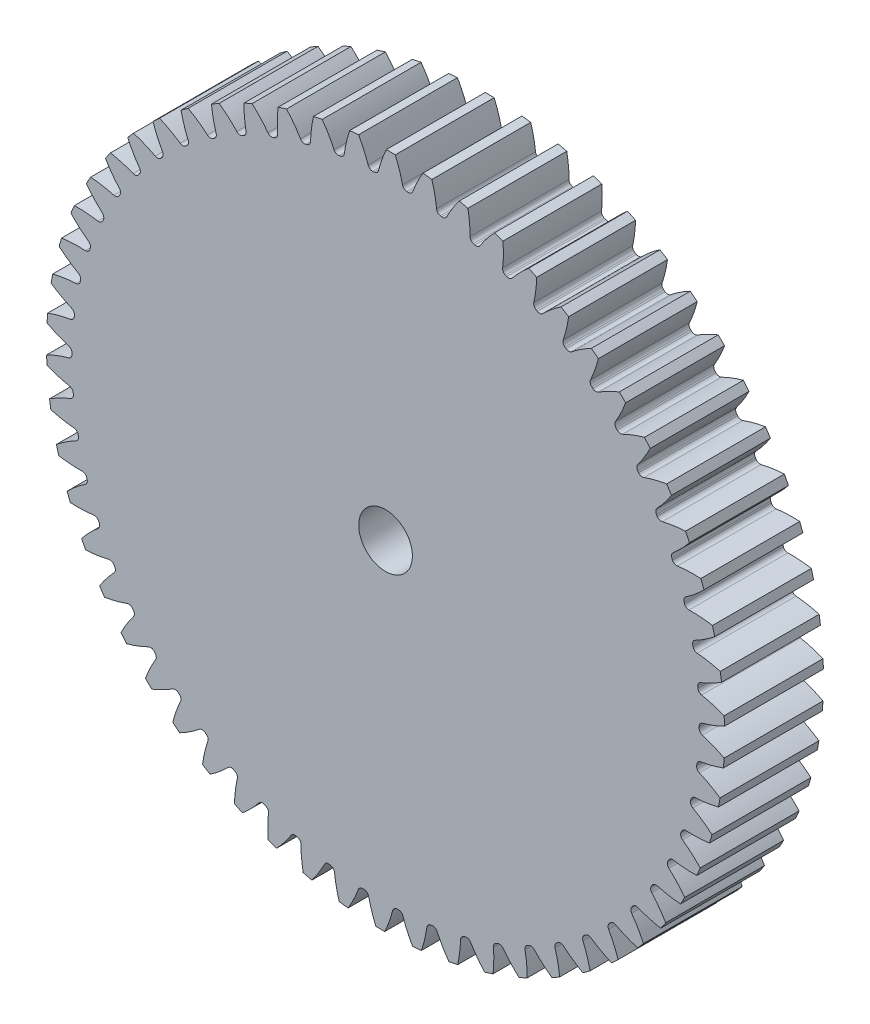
from build123d import *

# Parameters (mm, degrees)
SKETCH3_R         = 304.8
GEARBODY_DEPTH    = 88.9
TOOTHCUT_DEPTH    = 441.12417566
CIRPATTERN1_COUNT = 58
BOREDIA_R         = 24.13
BORE_DEPTH        = 12700


with BuildPart() as part:
    # Sketch3 → gearBody (new body)
    with BuildSketch(Plane.XY):
        Circle(SKETCH3_R)
    extrude(amount=GEARBODY_DEPTH)

    # Sketch2 → toothCut (cut, through all)
    with BuildSketch(Plane.XY):
        with BuildLine():
            ThreePointArc((281.894911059, -5.042094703), (281.906004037, -4.378183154), (281.91553339, -3.71424732))
            ThreePointArc((281.91553339, -3.71424732), (282.777149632, -1.241720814), (284.951102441, 0.217628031))
            ThreePointArc((284.951102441, 0.217628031), (295.060349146, 3.540619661), (304.8, 7.827616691))
            ThreePointArc((304.8, 7.827616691), (304.863730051, -4.734731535), (304.409921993, -17.289042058))
            ThreePointArc((304.409921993, -17.289042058), (294.808096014, -12.701659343), (284.806916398, -9.066339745))
            ThreePointArc((284.806916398, -9.066339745), (282.679330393, -7.54018521), (281.894911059, -5.042094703))
        make_face()
    toothcut = extrude(amount=TOOTHCUT_DEPTH, mode=Mode.SUBTRACT)

    # CirPattern1: toothCut ×58 about axis
    cirpattern1_axis = Axis((0, 0, 0), (0, 0, 1))
    for i in range(1, CIRPATTERN1_COUNT):
        add(toothcut.rotate(cirpattern1_axis, i * 360 / CIRPATTERN1_COUNT), mode=Mode.SUBTRACT)

    # boreDia → bore (cut, symmetric)
    with BuildSketch(Plane.XY):
        Circle(BOREDIA_R)
    extrude(amount=BORE_DEPTH, both=True, mode=Mode.SUBTRACT)


solid = part.part
